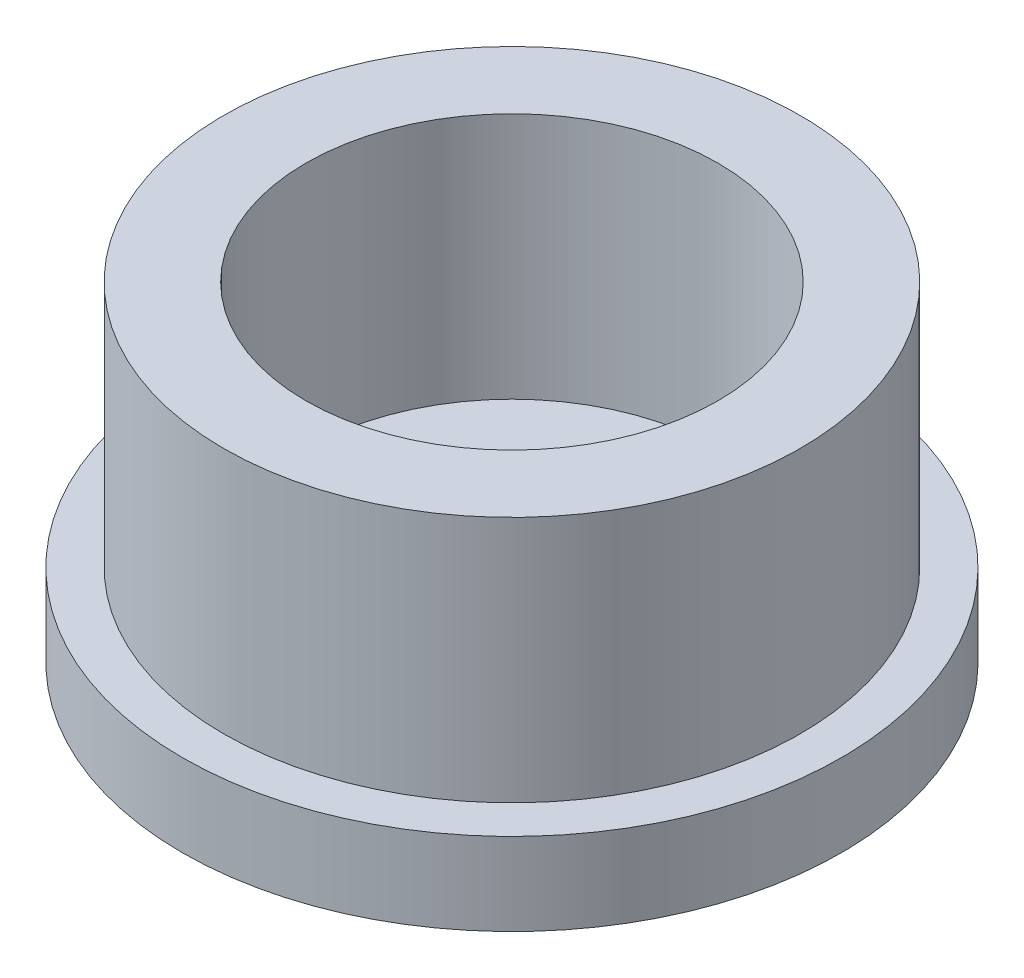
ISO-10303-21;
HEADER;
FILE_DESCRIPTION(('STEP AP214'),'2;1');
FILE_NAME('part.step','',(''),(''),'','','');
FILE_SCHEMA(('AUTOMOTIVE_DESIGN { 1 0 10303 214 1 1 1 1 }'));
ENDSEC;
DATA;
#1=APPLICATION_CONTEXT('core data for automotive mechanical design processes');
#2=APPLICATION_PROTOCOL_DEFINITION('international standard','automotive_design',2000,#1);
#3=PRODUCT_CONTEXT('',#1,'mechanical');
#4=PRODUCT('Part','Part','',(#3));
#5=PRODUCT_RELATED_PRODUCT_CATEGORY('part','',(#4));
#6=PRODUCT_DEFINITION_FORMATION('','',#4);
#7=PRODUCT_DEFINITION_CONTEXT('part definition',#1,'design');
#8=PRODUCT_DEFINITION('design','',#6,#7);
#9=PRODUCT_DEFINITION_SHAPE('','',#8);
#10=(LENGTH_UNIT() NAMED_UNIT(*) SI_UNIT(.MILLI.,.METRE.));
#11=(NAMED_UNIT(*) PLANE_ANGLE_UNIT() SI_UNIT($,.RADIAN.));
#12=(NAMED_UNIT(*) SI_UNIT($,.STERADIAN.) SOLID_ANGLE_UNIT());
#13=UNCERTAINTY_MEASURE_WITH_UNIT(LENGTH_MEASURE(1.E-05),#10,'distance_accuracy_value','');
#14=(GEOMETRIC_REPRESENTATION_CONTEXT(3) GLOBAL_UNCERTAINTY_ASSIGNED_CONTEXT((#13)) GLOBAL_UNIT_ASSIGNED_CONTEXT((#10,
#11,#12)) REPRESENTATION_CONTEXT('',''));
#15=CARTESIAN_POINT('',(0.,0.,0.));
#16=DIRECTION('',(0.,0.,1.));
#17=DIRECTION('',(1.,0.,0.));
#18=AXIS2_PLACEMENT_3D('',#15,#16,#17);
#19=CARTESIAN_POINT('',(0.,1.,0.));
#20=DIRECTION('',(0.,1.,0.));
#21=DIRECTION('',(0.,0.,1.));
#22=AXIS2_PLACEMENT_3D('',#19,#20,#21);
#23=PLANE('',#22);
#24=CARTESIAN_POINT('',(0.,1.,0.));
#25=DIRECTION('',(0.,1.,0.));
#26=DIRECTION('',(0.,0.,1.));
#27=AXIS2_PLACEMENT_3D('',#24,#25,#26);
#28=CIRCLE('',#27,1.1);
#29=CARTESIAN_POINT('',(0.,1.,1.1));
#30=VERTEX_POINT('',#29);
#31=EDGE_CURVE('E55',#30,#30,#28,.T.);
#32=ORIENTED_EDGE('',*,*,#31,.F.);
#33=EDGE_LOOP('',(#32));
#34=FACE_BOUND('',#33,.T.);
#35=CARTESIAN_POINT('',(0.,1.,0.));
#36=DIRECTION('',(0.,1.,0.));
#37=DIRECTION('',(0.,0.,1.));
#38=AXIS2_PLACEMENT_3D('',#35,#36,#37);
#39=CIRCLE('',#38,2.5);
#40=CARTESIAN_POINT('',(0.,1.,2.5));
#41=VERTEX_POINT('',#40);
#42=EDGE_CURVE('E64',#41,#41,#39,.T.);
#43=ORIENTED_EDGE('',*,*,#42,.T.);
#44=EDGE_LOOP('',(#43));
#45=FACE_BOUND('',#44,.T.);
#46=ADVANCED_FACE('F35',(#34,#45),#23,.T.);
#47=CARTESIAN_POINT('',(0.,1.,0.));
#48=DIRECTION('',(0.,-1.,0.));
#49=DIRECTION('',(0.,0.,-1.));
#50=AXIS2_PLACEMENT_3D('',#47,#48,#49);
#51=CYLINDRICAL_SURFACE('',#50,4.);
#52=CARTESIAN_POINT('',(0.,1.,0.));
#53=DIRECTION('',(0.,1.,0.));
#54=DIRECTION('',(0.,0.,1.));
#55=AXIS2_PLACEMENT_3D('',#52,#53,#54);
#56=CIRCLE('',#55,4.);
#57=CARTESIAN_POINT('',(0.,1.,4.));
#58=VERTEX_POINT('',#57);
#59=EDGE_CURVE('E43',#58,#58,#56,.T.);
#60=ORIENTED_EDGE('',*,*,#59,.F.);
#61=EDGE_LOOP('',(#60));
#62=FACE_BOUND('',#61,.T.);
#63=CARTESIAN_POINT('',(0.,0.,0.));
#64=DIRECTION('',(0.,1.,0.));
#65=DIRECTION('',(0.,0.,1.));
#66=AXIS2_PLACEMENT_3D('',#63,#64,#65);
#67=CIRCLE('',#66,4.);
#68=CARTESIAN_POINT('',(0.,0.,4.));
#69=VERTEX_POINT('',#68);
#70=EDGE_CURVE('E39',#69,#69,#67,.T.);
#71=ORIENTED_EDGE('',*,*,#70,.T.);
#72=EDGE_LOOP('',(#71));
#73=FACE_BOUND('',#72,.T.);
#74=ADVANCED_FACE('F37',(#62,#73),#51,.T.);
#75=CARTESIAN_POINT('',(0.,1.,0.));
#76=DIRECTION('',(0.,1.,0.));
#77=DIRECTION('',(0.,0.,1.));
#78=AXIS2_PLACEMENT_3D('',#75,#76,#77);
#79=CIRCLE('',#78,3.5);
#80=CARTESIAN_POINT('',(0.,1.,3.5));
#81=VERTEX_POINT('',#80);
#82=EDGE_CURVE('E10',#81,#81,#79,.T.);
#83=ORIENTED_EDGE('',*,*,#82,.F.);
#84=EDGE_LOOP('',(#83));
#85=FACE_BOUND('',#84,.T.);
#86=ORIENTED_EDGE('',*,*,#59,.T.);
#87=EDGE_LOOP('',(#86));
#88=FACE_BOUND('',#87,.T.);
#89=ADVANCED_FACE('F86',(#85,#88),#23,.T.);
#90=CARTESIAN_POINT('',(0.,0.,0.));
#91=DIRECTION('',(0.,1.,0.));
#92=DIRECTION('',(0.,0.,1.));
#93=AXIS2_PLACEMENT_3D('',#90,#91,#92);
#94=PLANE('',#93);
#95=CARTESIAN_POINT('',(0.,0.,0.));
#96=DIRECTION('',(0.,1.,0.));
#97=DIRECTION('',(0.,0.,1.));
#98=AXIS2_PLACEMENT_3D('',#95,#96,#97);
#99=CIRCLE('',#98,1.1);
#100=CARTESIAN_POINT('',(0.,0.,1.1));
#101=VERTEX_POINT('',#100);
#102=EDGE_CURVE('E52',#101,#101,#99,.T.);
#103=ORIENTED_EDGE('',*,*,#102,.T.);
#104=EDGE_LOOP('',(#103));
#105=FACE_BOUND('',#104,.T.);
#106=ORIENTED_EDGE('',*,*,#70,.F.);
#107=EDGE_LOOP('',(#106));
#108=FACE_BOUND('',#107,.T.);
#109=ADVANCED_FACE('F94',(#105,#108),#94,.F.);
#110=CARTESIAN_POINT('',(0.,0.,0.));
#111=DIRECTION('',(0.,1.,0.));
#112=DIRECTION('',(0.,0.,1.));
#113=AXIS2_PLACEMENT_3D('',#110,#111,#112);
#114=CYLINDRICAL_SURFACE('',#113,1.1);
#115=ORIENTED_EDGE('',*,*,#102,.F.);
#116=EDGE_LOOP('',(#115));
#117=FACE_BOUND('',#116,.T.);
#118=ORIENTED_EDGE('',*,*,#31,.T.);
#119=EDGE_LOOP('',(#118));
#120=FACE_BOUND('',#119,.T.);
#121=ADVANCED_FACE('F100',(#117,#120),#114,.F.);
#122=CARTESIAN_POINT('',(0.,4.,0.));
#123=DIRECTION('',(0.,1.,0.));
#124=DIRECTION('',(0.,0.,1.));
#125=AXIS2_PLACEMENT_3D('',#122,#123,#124);
#126=PLANE('',#125);
#127=CARTESIAN_POINT('',(0.,4.,0.));
#128=DIRECTION('',(0.,1.,0.));
#129=DIRECTION('',(0.,0.,1.));
#130=AXIS2_PLACEMENT_3D('',#127,#128,#129);
#131=CIRCLE('',#130,3.5);
#132=CARTESIAN_POINT('',(0.,4.,3.5));
#133=VERTEX_POINT('',#132);
#134=EDGE_CURVE('E50',#133,#133,#131,.T.);
#135=ORIENTED_EDGE('',*,*,#134,.T.);
#136=EDGE_LOOP('',(#135));
#137=FACE_BOUND('',#136,.T.);
#138=CARTESIAN_POINT('',(0.,4.,0.));
#139=DIRECTION('',(0.,1.,0.));
#140=DIRECTION('',(0.,0.,1.));
#141=AXIS2_PLACEMENT_3D('',#138,#139,#140);
#142=CIRCLE('',#141,2.5);
#143=CARTESIAN_POINT('',(0.,4.,2.5));
#144=VERTEX_POINT('',#143);
#145=EDGE_CURVE('E60',#144,#144,#142,.T.);
#146=ORIENTED_EDGE('',*,*,#145,.F.);
#147=EDGE_LOOP('',(#146));
#148=FACE_BOUND('',#147,.T.);
#149=ADVANCED_FACE('F79',(#137,#148),#126,.T.);
#150=CARTESIAN_POINT('',(0.,4.,0.));
#151=DIRECTION('',(0.,-1.,0.));
#152=DIRECTION('',(0.,0.,-1.));
#153=AXIS2_PLACEMENT_3D('',#150,#151,#152);
#154=CYLINDRICAL_SURFACE('',#153,3.5);
#155=ORIENTED_EDGE('',*,*,#134,.F.);
#156=EDGE_LOOP('',(#155));
#157=FACE_BOUND('',#156,.T.);
#158=ORIENTED_EDGE('',*,*,#82,.T.);
#159=EDGE_LOOP('',(#158));
#160=FACE_BOUND('',#159,.T.);
#161=ADVANCED_FACE('F74',(#157,#160),#154,.T.);
#162=CARTESIAN_POINT('',(0.,4.,0.));
#163=DIRECTION('',(0.,-1.,0.));
#164=DIRECTION('',(0.,0.,-1.));
#165=AXIS2_PLACEMENT_3D('',#162,#163,#164);
#166=CYLINDRICAL_SURFACE('',#165,2.5);
#167=ORIENTED_EDGE('',*,*,#145,.T.);
#168=EDGE_LOOP('',(#167));
#169=FACE_BOUND('',#168,.T.);
#170=ORIENTED_EDGE('',*,*,#42,.F.);
#171=EDGE_LOOP('',(#170));
#172=FACE_BOUND('',#171,.T.);
#173=ADVANCED_FACE('F72',(#169,#172),#166,.F.);
#174=CLOSED_SHELL('',(#46,#74,#89,#109,#121,#149,#161,#173));
#175=MANIFOLD_SOLID_BREP('B2',#174);
#176=ADVANCED_BREP_SHAPE_REPRESENTATION('',(#18,#175),#14);
#177=SHAPE_DEFINITION_REPRESENTATION(#9,#176);
ENDSEC;
END-ISO-10303-21;
